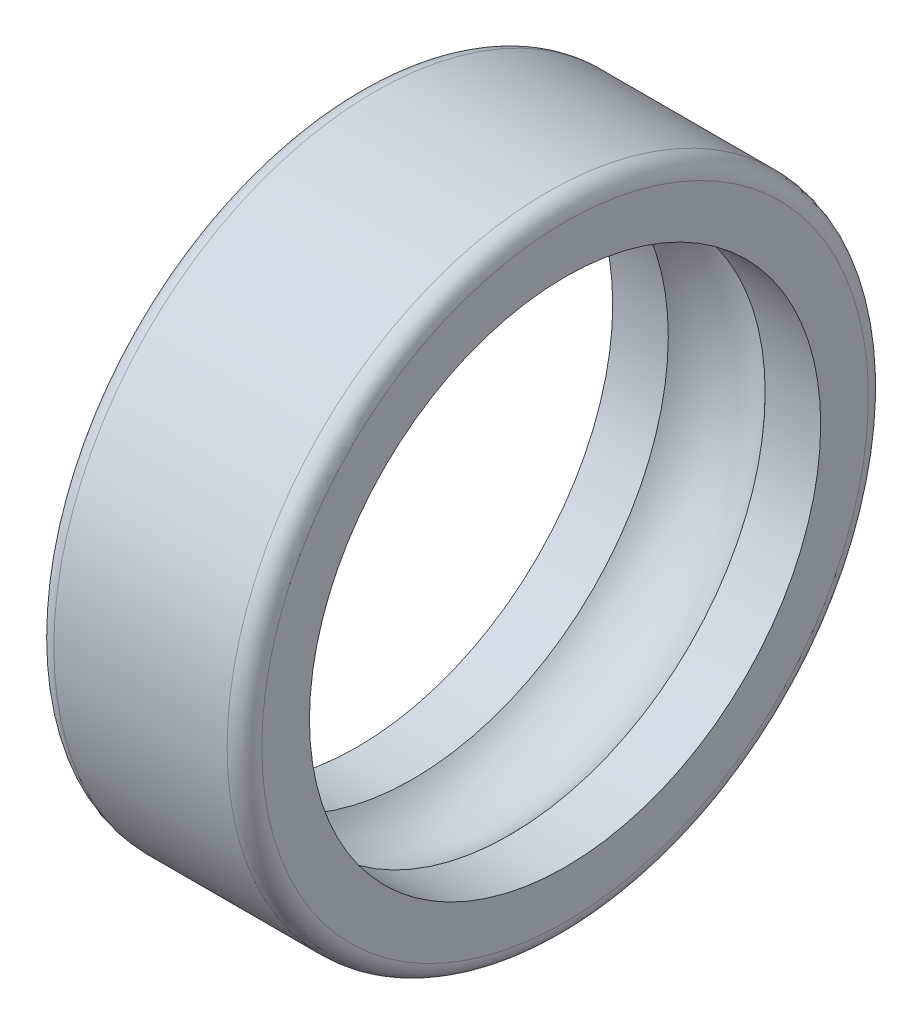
from build123d import *


with BuildPart() as part:
    # Esquisse1 → Base-R_volution (revolve)
    with BuildSketch(Plane(origin=(0, 0, 0), x_dir=(1, 0, 0), z_dir=(0, 1, 0)), mode=Mode.PRIVATE) as base_r_volution_sk:
        with BuildLine():
            Line((0, 17.5), (0, 14.75))
            Line((0, 14.75), (3.204915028, 14.75))
            ThreePointArc((3.204915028, 14.75), (6, 16), (8.795084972, 14.75))
            Line((8.795084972, 14.75), (12, 14.75))
            Line((12, 14.75), (12, 17.5))
            ThreePointArc((12, 17.5), (11.707106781, 18.207106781), (11, 18.5))
            Line((11, 18.5), (1, 18.5))
            ThreePointArc((1, 18.5), (0.292893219, 18.207106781), (0, 17.5))
        make_face()
    revolve(base_r_volution_sk.sketch.rotate(Axis((0, 0, 0), (1, 0, 0)), 180), axis=Axis((0, 0, 0), (1, 0, 0)))


solid = part.part
